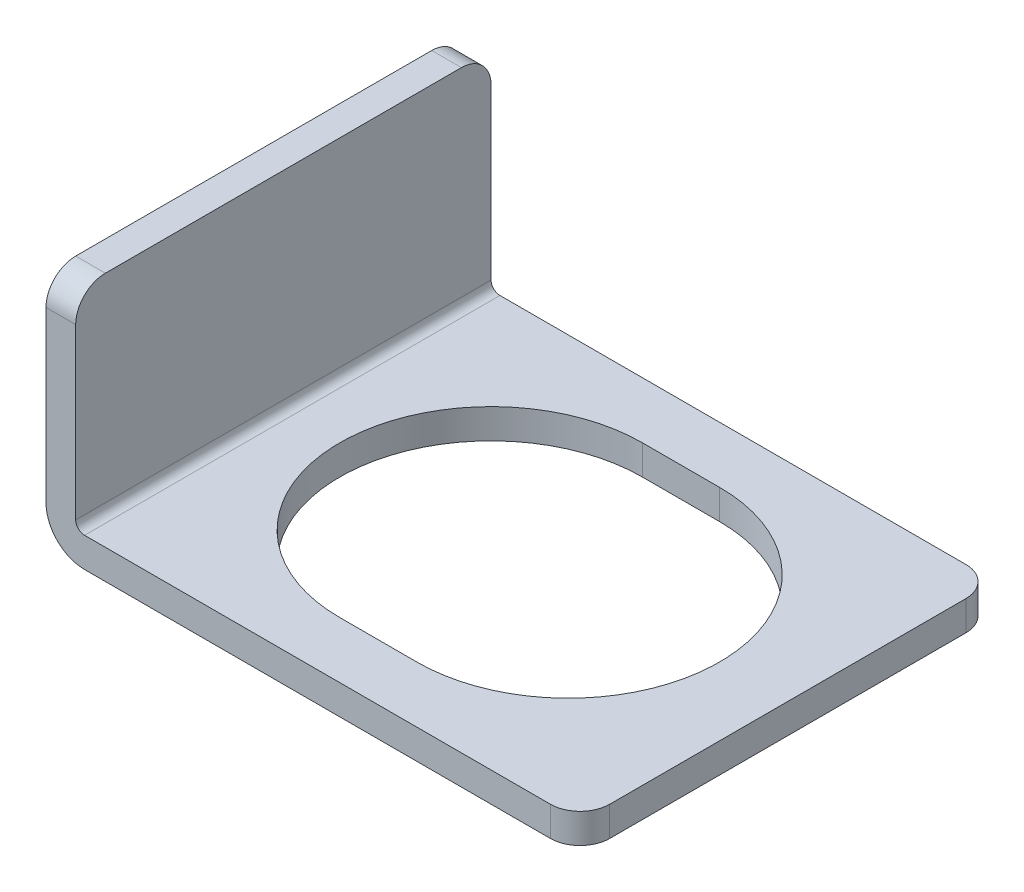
ISO-10303-21;
HEADER;
FILE_DESCRIPTION(('STEP AP214'),'2;1');
FILE_NAME('part.step','',(''),(''),'','','');
FILE_SCHEMA(('AUTOMOTIVE_DESIGN { 1 0 10303 214 1 1 1 1 }'));
ENDSEC;
DATA;
#1=APPLICATION_CONTEXT('core data for automotive mechanical design processes');
#2=APPLICATION_PROTOCOL_DEFINITION('international standard','automotive_design',2000,#1);
#3=PRODUCT_CONTEXT('',#1,'mechanical');
#4=PRODUCT('Part','Part','',(#3));
#5=PRODUCT_RELATED_PRODUCT_CATEGORY('part','',(#4));
#6=PRODUCT_DEFINITION_FORMATION('','',#4);
#7=PRODUCT_DEFINITION_CONTEXT('part definition',#1,'design');
#8=PRODUCT_DEFINITION('design','',#6,#7);
#9=PRODUCT_DEFINITION_SHAPE('','',#8);
#10=(LENGTH_UNIT() NAMED_UNIT(*) SI_UNIT(.MILLI.,.METRE.));
#11=(NAMED_UNIT(*) PLANE_ANGLE_UNIT() SI_UNIT($,.RADIAN.));
#12=(NAMED_UNIT(*) SI_UNIT($,.STERADIAN.) SOLID_ANGLE_UNIT());
#13=UNCERTAINTY_MEASURE_WITH_UNIT(LENGTH_MEASURE(1.E-05),#10,'distance_accuracy_value','');
#14=(GEOMETRIC_REPRESENTATION_CONTEXT(3) GLOBAL_UNCERTAINTY_ASSIGNED_CONTEXT((#13)) GLOBAL_UNIT_ASSIGNED_CONTEXT((#10,
#11,#12)) REPRESENTATION_CONTEXT('',''));
#15=CARTESIAN_POINT('',(0.,0.,0.));
#16=DIRECTION('',(0.,0.,1.));
#17=DIRECTION('',(1.,0.,0.));
#18=AXIS2_PLACEMENT_3D('',#15,#16,#17);
#19=CARTESIAN_POINT('',(-7.,0.3,7.));
#20=DIRECTION('',(-1.,0.,0.));
#21=DIRECTION('',(0.,-1.,0.));
#22=AXIS2_PLACEMENT_3D('',#19,#20,#21);
#23=PLANE('',#22);
#24=DIRECTION('',(0.,1.,0.));
#25=VECTOR('',#24,1.);
#26=CARTESIAN_POINT('',(-7.,0.3,-7.));
#27=LINE('',#26,#25);
#28=CARTESIAN_POINT('',(-7.,0.3,-7.));
#29=VERTEX_POINT('',#28);
#30=CARTESIAN_POINT('',(-7.,6.,-7.));
#31=VERTEX_POINT('',#30);
#32=EDGE_CURVE('E167',#29,#31,#27,.T.);
#33=ORIENTED_EDGE('',*,*,#32,.T.);
#34=CARTESIAN_POINT('',(-7.,6.,-6.));
#35=DIRECTION('',(-1.,0.,0.));
#36=DIRECTION('',(0.,-1.,0.));
#37=AXIS2_PLACEMENT_3D('',#34,#35,#36);
#38=CIRCLE('',#37,1.);
#39=CARTESIAN_POINT('',(-7.,7.,-6.));
#40=VERTEX_POINT('',#39);
#41=EDGE_CURVE('E245',#31,#40,#38,.F.);
#42=ORIENTED_EDGE('',*,*,#41,.T.);
#43=DIRECTION('',(0.,0.,-1.));
#44=VECTOR('',#43,1.);
#45=CARTESIAN_POINT('',(-7.,7.,7.));
#46=LINE('',#45,#44);
#47=CARTESIAN_POINT('',(-7.,7.,6.));
#48=VERTEX_POINT('',#47);
#49=EDGE_CURVE('E218',#48,#40,#46,.T.);
#50=ORIENTED_EDGE('',*,*,#49,.F.);
#51=CARTESIAN_POINT('',(-7.,6.,6.));
#52=DIRECTION('',(-1.,0.,0.));
#53=DIRECTION('',(0.,-1.,0.));
#54=AXIS2_PLACEMENT_3D('',#51,#52,#53);
#55=CIRCLE('',#54,1.);
#56=CARTESIAN_POINT('',(-7.,6.,7.));
#57=VERTEX_POINT('',#56);
#58=EDGE_CURVE('E243',#48,#57,#55,.F.);
#59=ORIENTED_EDGE('',*,*,#58,.T.);
#60=DIRECTION('',(0.,1.,0.));
#61=VECTOR('',#60,1.);
#62=CARTESIAN_POINT('',(-7.,0.3,7.));
#63=LINE('',#62,#61);
#64=CARTESIAN_POINT('',(-7.,0.3,7.));
#65=VERTEX_POINT('',#64);
#66=EDGE_CURVE('E171',#65,#57,#63,.T.);
#67=ORIENTED_EDGE('',*,*,#66,.F.);
#68=DIRECTION('',(0.,0.,-1.));
#69=VECTOR('',#68,1.);
#70=CARTESIAN_POINT('',(-7.,0.3,7.));
#71=LINE('',#70,#69);
#72=EDGE_CURVE('E186',#65,#29,#71,.T.);
#73=ORIENTED_EDGE('',*,*,#72,.T.);
#74=EDGE_LOOP('',(#33,#42,#50,#59,#67,#73));
#75=FACE_BOUND('',#74,.T.);
#76=ADVANCED_FACE('F14',(#75),#23,.F.);
#77=CARTESIAN_POINT('',(-8.,7.,7.));
#78=DIRECTION('',(0.,1.,0.));
#79=DIRECTION('',(0.,0.,1.));
#80=AXIS2_PLACEMENT_3D('',#77,#78,#79);
#81=PLANE('',#80);
#82=ORIENTED_EDGE('',*,*,#49,.T.);
#83=DIRECTION('',(1.,0.,0.));
#84=VECTOR('',#83,1.);
#85=CARTESIAN_POINT('',(-8.,7.,-6.));
#86=LINE('',#85,#84);
#87=CARTESIAN_POINT('',(-8.,7.,-6.));
#88=VERTEX_POINT('',#87);
#89=EDGE_CURVE('E29',#40,#88,#86,.F.);
#90=ORIENTED_EDGE('',*,*,#89,.T.);
#91=DIRECTION('',(0.,0.,-1.));
#92=VECTOR('',#91,1.);
#93=CARTESIAN_POINT('',(-8.,7.,7.));
#94=LINE('',#93,#92);
#95=CARTESIAN_POINT('',(-8.,7.,6.));
#96=VERTEX_POINT('',#95);
#97=EDGE_CURVE('E216',#96,#88,#94,.T.);
#98=ORIENTED_EDGE('',*,*,#97,.F.);
#99=DIRECTION('',(1.,0.,0.));
#100=VECTOR('',#99,1.);
#101=CARTESIAN_POINT('',(-8.,7.,6.));
#102=LINE('',#101,#100);
#103=EDGE_CURVE('E247',#96,#48,#102,.T.);
#104=ORIENTED_EDGE('',*,*,#103,.T.);
#105=EDGE_LOOP('',(#82,#90,#98,#104));
#106=FACE_BOUND('',#105,.T.);
#107=ADVANCED_FACE('F252',(#106),#81,.T.);
#108=CARTESIAN_POINT('',(-8.,0.3,7.));
#109=DIRECTION('',(-1.,0.,0.));
#110=DIRECTION('',(0.,-1.,0.));
#111=AXIS2_PLACEMENT_3D('',#108,#109,#110);
#112=PLANE('',#111);
#113=ORIENTED_EDGE('',*,*,#97,.T.);
#114=CARTESIAN_POINT('',(-8.,6.,-6.));
#115=DIRECTION('',(-1.,0.,0.));
#116=DIRECTION('',(0.,-1.,0.));
#117=AXIS2_PLACEMENT_3D('',#114,#115,#116);
#118=CIRCLE('',#117,1.);
#119=CARTESIAN_POINT('',(-8.,6.,-7.));
#120=VERTEX_POINT('',#119);
#121=EDGE_CURVE('E9',#88,#120,#118,.T.);
#122=ORIENTED_EDGE('',*,*,#121,.T.);
#123=DIRECTION('',(0.,1.,0.));
#124=VECTOR('',#123,1.);
#125=CARTESIAN_POINT('',(-8.,0.3,-7.));
#126=LINE('',#125,#124);
#127=CARTESIAN_POINT('',(-8.,0.3,-7.));
#128=VERTEX_POINT('',#127);
#129=EDGE_CURVE('E189',#128,#120,#126,.T.);
#130=ORIENTED_EDGE('',*,*,#129,.F.);
#131=DIRECTION('',(0.,0.,-1.));
#132=VECTOR('',#131,1.);
#133=CARTESIAN_POINT('',(-8.,0.3,7.));
#134=LINE('',#133,#132);
#135=CARTESIAN_POINT('',(-8.,0.3,7.));
#136=VERTEX_POINT('',#135);
#137=EDGE_CURVE('E214',#136,#128,#134,.T.);
#138=ORIENTED_EDGE('',*,*,#137,.F.);
#139=DIRECTION('',(0.,1.,0.));
#140=VECTOR('',#139,1.);
#141=CARTESIAN_POINT('',(-8.,0.3,7.));
#142=LINE('',#141,#140);
#143=CARTESIAN_POINT('',(-8.,6.,7.));
#144=VERTEX_POINT('',#143);
#145=EDGE_CURVE('E174',#136,#144,#142,.T.);
#146=ORIENTED_EDGE('',*,*,#145,.T.);
#147=CARTESIAN_POINT('',(-8.,6.,6.));
#148=DIRECTION('',(-1.,0.,0.));
#149=DIRECTION('',(0.,-1.,0.));
#150=AXIS2_PLACEMENT_3D('',#147,#148,#149);
#151=CIRCLE('',#150,1.);
#152=EDGE_CURVE('E22',#144,#96,#151,.T.);
#153=ORIENTED_EDGE('',*,*,#152,.T.);
#154=EDGE_LOOP('',(#113,#122,#130,#138,#146,#153));
#155=FACE_BOUND('',#154,.T.);
#156=ADVANCED_FACE('F267',(#155),#112,.T.);
#157=CARTESIAN_POINT('',(-6.7,0.3,7.));
#158=DIRECTION('',(0.,0.,-1.));
#159=DIRECTION('',(-1.,0.,0.));
#160=AXIS2_PLACEMENT_3D('',#157,#158,#159);
#161=CYLINDRICAL_SURFACE('',#160,1.3);
#162=CARTESIAN_POINT('',(-6.7,0.3,-7.));
#163=DIRECTION('',(0.,0.,1.));
#164=DIRECTION('',(1.,0.,0.));
#165=AXIS2_PLACEMENT_3D('',#162,#163,#164);
#166=CIRCLE('',#165,1.3);
#167=CARTESIAN_POINT('',(-6.7,-1.,-7.));
#168=VERTEX_POINT('',#167);
#169=EDGE_CURVE('E192',#168,#128,#166,.F.);
#170=ORIENTED_EDGE('',*,*,#169,.F.);
#171=DIRECTION('',(0.,0.,-1.));
#172=VECTOR('',#171,1.);
#173=CARTESIAN_POINT('',(-6.7,-1.,7.));
#174=LINE('',#173,#172);
#175=CARTESIAN_POINT('',(-6.7,-1.,7.));
#176=VERTEX_POINT('',#175);
#177=EDGE_CURVE('E211',#176,#168,#174,.T.);
#178=ORIENTED_EDGE('',*,*,#177,.F.);
#179=CARTESIAN_POINT('',(-6.7,0.3,7.));
#180=DIRECTION('',(0.,0.,1.));
#181=DIRECTION('',(1.,0.,0.));
#182=AXIS2_PLACEMENT_3D('',#179,#180,#181);
#183=CIRCLE('',#182,1.3);
#184=EDGE_CURVE('E177',#176,#136,#183,.F.);
#185=ORIENTED_EDGE('',*,*,#184,.T.);
#186=ORIENTED_EDGE('',*,*,#137,.T.);
#187=EDGE_LOOP('',(#170,#178,#185,#186));
#188=FACE_BOUND('',#187,.T.);
#189=ADVANCED_FACE('F276',(#188),#161,.T.);
#190=CARTESIAN_POINT('',(0.,-1.,7.));
#191=DIRECTION('',(0.,-1.,0.));
#192=DIRECTION('',(0.,0.,-1.));
#193=AXIS2_PLACEMENT_3D('',#190,#191,#192);
#194=PLANE('',#193);
#195=CARTESIAN_POINT('',(0.,-1.,0.));
#196=DIRECTION('',(0.,1.,0.));
#197=DIRECTION('',(-1.,0.,0.));
#198=AXIS2_PLACEMENT_3D('',#195,#196,#197);
#199=CIRCLE('',#198,5.1);
#200=CARTESIAN_POINT('',(0.,-1.,-5.1));
#201=VERTEX_POINT('',#200);
#202=CARTESIAN_POINT('',(0.,-1.,5.1));
#203=VERTEX_POINT('',#202);
#204=EDGE_CURVE('E131',#201,#203,#199,.T.);
#205=ORIENTED_EDGE('',*,*,#204,.T.);
#206=DIRECTION('',(1.,0.,0.));
#207=VECTOR('',#206,1.);
#208=CARTESIAN_POINT('',(0.,-1.,5.1));
#209=LINE('',#208,#207);
#210=CARTESIAN_POINT('',(2.6,-1.,5.1));
#211=VERTEX_POINT('',#210);
#212=EDGE_CURVE('E143',#203,#211,#209,.T.);
#213=ORIENTED_EDGE('',*,*,#212,.T.);
#214=CARTESIAN_POINT('',(2.6,-1.,0.));
#215=DIRECTION('',(0.,1.,0.));
#216=DIRECTION('',(1.,0.,0.));
#217=AXIS2_PLACEMENT_3D('',#214,#215,#216);
#218=CIRCLE('',#217,5.1);
#219=CARTESIAN_POINT('',(2.6,-1.,-5.1));
#220=VERTEX_POINT('',#219);
#221=EDGE_CURVE('E147',#211,#220,#218,.T.);
#222=ORIENTED_EDGE('',*,*,#221,.T.);
#223=DIRECTION('',(-1.,0.,0.));
#224=VECTOR('',#223,1.);
#225=CARTESIAN_POINT('',(0.,-1.,-5.1));
#226=LINE('',#225,#224);
#227=EDGE_CURVE('E139',#220,#201,#226,.T.);
#228=ORIENTED_EDGE('',*,*,#227,.T.);
#229=EDGE_LOOP('',(#205,#213,#222,#228));
#230=FACE_BOUND('',#229,.T.);
#231=DIRECTION('',(1.,0.,0.));
#232=VECTOR('',#231,1.);
#233=CARTESIAN_POINT('',(0.,-1.,-7.));
#234=LINE('',#233,#232);
#235=CARTESIAN_POINT('',(9.,-1.,-7.));
#236=VERTEX_POINT('',#235);
#237=EDGE_CURVE('E195',#236,#168,#234,.F.);
#238=ORIENTED_EDGE('',*,*,#237,.F.);
#239=CARTESIAN_POINT('',(9.,-1.,-6.));
#240=DIRECTION('',(0.,-1.,0.));
#241=DIRECTION('',(0.,0.,-1.));
#242=AXIS2_PLACEMENT_3D('',#239,#240,#241);
#243=CIRCLE('',#242,1.);
#244=CARTESIAN_POINT('',(10.,-1.,-6.));
#245=VERTEX_POINT('',#244);
#246=EDGE_CURVE('E228',#236,#245,#243,.T.);
#247=ORIENTED_EDGE('',*,*,#246,.T.);
#248=DIRECTION('',(0.,0.,-1.));
#249=VECTOR('',#248,1.);
#250=CARTESIAN_POINT('',(10.,-1.,7.));
#251=LINE('',#250,#249);
#252=CARTESIAN_POINT('',(10.,-1.,6.));
#253=VERTEX_POINT('',#252);
#254=EDGE_CURVE('E208',#253,#245,#251,.T.);
#255=ORIENTED_EDGE('',*,*,#254,.F.);
#256=CARTESIAN_POINT('',(9.,-1.,6.));
#257=DIRECTION('',(0.,-1.,0.));
#258=DIRECTION('',(0.,0.,-1.));
#259=AXIS2_PLACEMENT_3D('',#256,#257,#258);
#260=CIRCLE('',#259,1.);
#261=CARTESIAN_POINT('',(9.,-1.,7.));
#262=VERTEX_POINT('',#261);
#263=EDGE_CURVE('E226',#253,#262,#260,.T.);
#264=ORIENTED_EDGE('',*,*,#263,.T.);
#265=DIRECTION('',(-1.,0.,0.));
#266=VECTOR('',#265,1.);
#267=CARTESIAN_POINT('',(0.,-1.,7.));
#268=LINE('',#267,#266);
#269=EDGE_CURVE('E180',#262,#176,#268,.T.);
#270=ORIENTED_EDGE('',*,*,#269,.T.);
#271=ORIENTED_EDGE('',*,*,#177,.T.);
#272=EDGE_LOOP('',(#238,#247,#255,#264,#270,#271));
#273=FACE_BOUND('',#272,.T.);
#274=ADVANCED_FACE('F149',(#230,#273),#194,.T.);
#275=CARTESIAN_POINT('',(10.,0.,7.));
#276=DIRECTION('',(1.,0.,0.));
#277=DIRECTION('',(0.,0.,-1.));
#278=AXIS2_PLACEMENT_3D('',#275,#276,#277);
#279=PLANE('',#278);
#280=ORIENTED_EDGE('',*,*,#254,.T.);
#281=DIRECTION('',(0.,-1.,0.));
#282=VECTOR('',#281,1.);
#283=CARTESIAN_POINT('',(10.,0.,-6.));
#284=LINE('',#283,#282);
#285=CARTESIAN_POINT('',(10.,0.,-6.));
#286=VERTEX_POINT('',#285);
#287=EDGE_CURVE('E233',#245,#286,#284,.F.);
#288=ORIENTED_EDGE('',*,*,#287,.T.);
#289=DIRECTION('',(0.,0.,-1.));
#290=VECTOR('',#289,1.);
#291=CARTESIAN_POINT('',(10.,0.,7.));
#292=LINE('',#291,#290);
#293=CARTESIAN_POINT('',(10.,0.,6.));
#294=VERTEX_POINT('',#293);
#295=EDGE_CURVE('E205',#294,#286,#292,.T.);
#296=ORIENTED_EDGE('',*,*,#295,.F.);
#297=DIRECTION('',(0.,-1.,0.));
#298=VECTOR('',#297,1.);
#299=CARTESIAN_POINT('',(10.,0.,6.));
#300=LINE('',#299,#298);
#301=EDGE_CURVE('E230',#294,#253,#300,.T.);
#302=ORIENTED_EDGE('',*,*,#301,.T.);
#303=EDGE_LOOP('',(#280,#288,#296,#302));
#304=FACE_BOUND('',#303,.T.);
#305=ADVANCED_FACE('F291',(#304),#279,.T.);
#306=CARTESIAN_POINT('',(0.,0.,7.));
#307=DIRECTION('',(0.,-1.,0.));
#308=DIRECTION('',(1.,0.,0.));
#309=AXIS2_PLACEMENT_3D('',#306,#307,#308);
#310=PLANE('',#309);
#311=DIRECTION('',(1.,0.,0.));
#312=VECTOR('',#311,1.);
#313=CARTESIAN_POINT('',(0.,0.,5.1));
#314=LINE('',#313,#312);
#315=CARTESIAN_POINT('',(0.,0.,5.1));
#316=VERTEX_POINT('',#315);
#317=CARTESIAN_POINT('',(2.6,0.,5.1));
#318=VERTEX_POINT('',#317);
#319=EDGE_CURVE('E161',#316,#318,#314,.T.);
#320=ORIENTED_EDGE('',*,*,#319,.F.);
#321=CARTESIAN_POINT('',(0.,0.,0.));
#322=DIRECTION('',(0.,1.,0.));
#323=DIRECTION('',(-1.,0.,0.));
#324=AXIS2_PLACEMENT_3D('',#321,#322,#323);
#325=CIRCLE('',#324,5.1);
#326=CARTESIAN_POINT('',(0.,0.,-5.1));
#327=VERTEX_POINT('',#326);
#328=EDGE_CURVE('E134',#327,#316,#325,.T.);
#329=ORIENTED_EDGE('',*,*,#328,.F.);
#330=DIRECTION('',(-1.,0.,0.));
#331=VECTOR('',#330,1.);
#332=CARTESIAN_POINT('',(0.,0.,-5.1));
#333=LINE('',#332,#331);
#334=CARTESIAN_POINT('',(2.6,0.,-5.1));
#335=VERTEX_POINT('',#334);
#336=EDGE_CURVE('E152',#335,#327,#333,.T.);
#337=ORIENTED_EDGE('',*,*,#336,.F.);
#338=CARTESIAN_POINT('',(2.6,0.,0.));
#339=DIRECTION('',(0.,1.,0.));
#340=DIRECTION('',(1.,0.,0.));
#341=AXIS2_PLACEMENT_3D('',#338,#339,#340);
#342=CIRCLE('',#341,5.1);
#343=EDGE_CURVE('E155',#318,#335,#342,.T.);
#344=ORIENTED_EDGE('',*,*,#343,.F.);
#345=EDGE_LOOP('',(#320,#329,#337,#344));
#346=FACE_BOUND('',#345,.T.);
#347=ORIENTED_EDGE('',*,*,#295,.T.);
#348=CARTESIAN_POINT('',(9.,0.,-6.));
#349=DIRECTION('',(0.,-1.,0.));
#350=DIRECTION('',(1.,0.,0.));
#351=AXIS2_PLACEMENT_3D('',#348,#349,#350);
#352=CIRCLE('',#351,1.);
#353=CARTESIAN_POINT('',(9.,0.,-7.));
#354=VERTEX_POINT('',#353);
#355=EDGE_CURVE('E237',#286,#354,#352,.F.);
#356=ORIENTED_EDGE('',*,*,#355,.T.);
#357=DIRECTION('',(-1.,0.,0.));
#358=VECTOR('',#357,1.);
#359=CARTESIAN_POINT('',(0.,0.,-7.));
#360=LINE('',#359,#358);
#361=CARTESIAN_POINT('',(-6.7,0.,-7.));
#362=VERTEX_POINT('',#361);
#363=EDGE_CURVE('E197',#354,#362,#360,.T.);
#364=ORIENTED_EDGE('',*,*,#363,.T.);
#365=DIRECTION('',(0.,0.,-1.));
#366=VECTOR('',#365,1.);
#367=CARTESIAN_POINT('',(-6.7,0.,7.));
#368=LINE('',#367,#366);
#369=CARTESIAN_POINT('',(-6.7,0.,7.));
#370=VERTEX_POINT('',#369);
#371=EDGE_CURVE('E202',#370,#362,#368,.T.);
#372=ORIENTED_EDGE('',*,*,#371,.F.);
#373=DIRECTION('',(-1.,0.,0.));
#374=VECTOR('',#373,1.);
#375=CARTESIAN_POINT('',(0.,0.,7.));
#376=LINE('',#375,#374);
#377=CARTESIAN_POINT('',(9.,0.,7.));
#378=VERTEX_POINT('',#377);
#379=EDGE_CURVE('E182',#378,#370,#376,.T.);
#380=ORIENTED_EDGE('',*,*,#379,.F.);
#381=CARTESIAN_POINT('',(9.,0.,6.));
#382=DIRECTION('',(0.,-1.,0.));
#383=DIRECTION('',(1.,0.,0.));
#384=AXIS2_PLACEMENT_3D('',#381,#382,#383);
#385=CIRCLE('',#384,1.);
#386=EDGE_CURVE('E235',#378,#294,#385,.F.);
#387=ORIENTED_EDGE('',*,*,#386,.T.);
#388=EDGE_LOOP('',(#347,#356,#364,#372,#380,#387));
#389=FACE_BOUND('',#388,.T.);
#390=ADVANCED_FACE('F287',(#346,#389),#310,.F.);
#391=CARTESIAN_POINT('',(-6.7,0.3,7.));
#392=DIRECTION('',(0.,0.,-1.));
#393=DIRECTION('',(-1.,0.,0.));
#394=AXIS2_PLACEMENT_3D('',#391,#392,#393);
#395=CYLINDRICAL_SURFACE('',#394,0.3);
#396=CARTESIAN_POINT('',(-6.7,0.3,-7.));
#397=DIRECTION('',(0.,0.,-1.));
#398=DIRECTION('',(-1.,0.,0.));
#399=AXIS2_PLACEMENT_3D('',#396,#397,#398);
#400=CIRCLE('',#399,0.3);
#401=EDGE_CURVE('E175',#362,#29,#400,.T.);
#402=ORIENTED_EDGE('',*,*,#401,.T.);
#403=ORIENTED_EDGE('',*,*,#72,.F.);
#404=CARTESIAN_POINT('',(-6.7,0.3,7.));
#405=DIRECTION('',(0.,0.,-1.));
#406=DIRECTION('',(-1.,0.,0.));
#407=AXIS2_PLACEMENT_3D('',#404,#405,#406);
#408=CIRCLE('',#407,0.3);
#409=EDGE_CURVE('E184',#370,#65,#408,.T.);
#410=ORIENTED_EDGE('',*,*,#409,.F.);
#411=ORIENTED_EDGE('',*,*,#371,.T.);
#412=EDGE_LOOP('',(#402,#403,#410,#411));
#413=FACE_BOUND('',#412,.T.);
#414=ADVANCED_FACE('F298',(#413),#395,.F.);
#415=CARTESIAN_POINT('',(-6.7,0.3,7.));
#416=DIRECTION('',(0.,0.,1.));
#417=DIRECTION('',(1.,0.,0.));
#418=AXIS2_PLACEMENT_3D('',#415,#416,#417);
#419=PLANE('',#418);
#420=ORIENTED_EDGE('',*,*,#269,.F.);
#421=DIRECTION('',(0.,-1.,0.));
#422=VECTOR('',#421,1.);
#423=CARTESIAN_POINT('',(9.,0.3,7.));
#424=LINE('',#423,#422);
#425=EDGE_CURVE('E241',#262,#378,#424,.F.);
#426=ORIENTED_EDGE('',*,*,#425,.T.);
#427=ORIENTED_EDGE('',*,*,#379,.T.);
#428=ORIENTED_EDGE('',*,*,#409,.T.);
#429=ORIENTED_EDGE('',*,*,#66,.T.);
#430=DIRECTION('',(1.,0.,0.));
#431=VECTOR('',#430,1.);
#432=CARTESIAN_POINT('',(-6.7,6.,7.));
#433=LINE('',#432,#431);
#434=EDGE_CURVE('E239',#57,#144,#433,.F.);
#435=ORIENTED_EDGE('',*,*,#434,.T.);
#436=ORIENTED_EDGE('',*,*,#145,.F.);
#437=ORIENTED_EDGE('',*,*,#184,.F.);
#438=EDGE_LOOP('',(#420,#426,#427,#428,#429,#435,#436,#437));
#439=FACE_BOUND('',#438,.T.);
#440=ADVANCED_FACE('F273',(#439),#419,.T.);
#441=CARTESIAN_POINT('',(-6.7,0.3,-7.));
#442=DIRECTION('',(0.,0.,1.));
#443=DIRECTION('',(1.,0.,0.));
#444=AXIS2_PLACEMENT_3D('',#441,#442,#443);
#445=PLANE('',#444);
#446=ORIENTED_EDGE('',*,*,#363,.F.);
#447=DIRECTION('',(0.,-1.,0.));
#448=VECTOR('',#447,1.);
#449=CARTESIAN_POINT('',(9.,-1.,-7.));
#450=LINE('',#449,#448);
#451=EDGE_CURVE('E223',#354,#236,#450,.T.);
#452=ORIENTED_EDGE('',*,*,#451,.T.);
#453=ORIENTED_EDGE('',*,*,#237,.T.);
#454=ORIENTED_EDGE('',*,*,#169,.T.);
#455=ORIENTED_EDGE('',*,*,#129,.T.);
#456=DIRECTION('',(1.,0.,0.));
#457=VECTOR('',#456,1.);
#458=CARTESIAN_POINT('',(-7.,6.,-7.));
#459=LINE('',#458,#457);
#460=EDGE_CURVE('E220',#120,#31,#459,.T.);
#461=ORIENTED_EDGE('',*,*,#460,.T.);
#462=ORIENTED_EDGE('',*,*,#32,.F.);
#463=ORIENTED_EDGE('',*,*,#401,.F.);
#464=EDGE_LOOP('',(#446,#452,#453,#454,#455,#461,#462,#463));
#465=FACE_BOUND('',#464,.T.);
#466=ADVANCED_FACE('F263',(#465),#445,.F.);
#467=CARTESIAN_POINT('',(0.,-1.,0.));
#468=DIRECTION('',(0.,1.,0.));
#469=DIRECTION('',(-1.,0.,0.));
#470=AXIS2_PLACEMENT_3D('',#467,#468,#469);
#471=CYLINDRICAL_SURFACE('',#470,5.1);
#472=ORIENTED_EDGE('',*,*,#328,.T.);
#473=DIRECTION('',(0.,1.,0.));
#474=VECTOR('',#473,1.);
#475=CARTESIAN_POINT('',(0.,-1.,5.1));
#476=LINE('',#475,#474);
#477=EDGE_CURVE('E127',#203,#316,#476,.T.);
#478=ORIENTED_EDGE('',*,*,#477,.F.);
#479=ORIENTED_EDGE('',*,*,#204,.F.);
#480=DIRECTION('',(0.,1.,0.));
#481=VECTOR('',#480,1.);
#482=CARTESIAN_POINT('',(0.,-1.,-5.1));
#483=LINE('',#482,#481);
#484=EDGE_CURVE('E165',#201,#327,#483,.T.);
#485=ORIENTED_EDGE('',*,*,#484,.T.);
#486=EDGE_LOOP('',(#472,#478,#479,#485));
#487=FACE_BOUND('',#486,.T.);
#488=ADVANCED_FACE('F129',(#487),#471,.F.);
#489=CARTESIAN_POINT('',(0.,-1.,-5.1));
#490=DIRECTION('',(0.,0.,-1.));
#491=DIRECTION('',(-1.,0.,0.));
#492=AXIS2_PLACEMENT_3D('',#489,#490,#491);
#493=PLANE('',#492);
#494=ORIENTED_EDGE('',*,*,#336,.T.);
#495=ORIENTED_EDGE('',*,*,#484,.F.);
#496=ORIENTED_EDGE('',*,*,#227,.F.);
#497=DIRECTION('',(0.,1.,0.));
#498=VECTOR('',#497,1.);
#499=CARTESIAN_POINT('',(2.6,-1.,-5.1));
#500=LINE('',#499,#498);
#501=EDGE_CURVE('E168',#220,#335,#500,.T.);
#502=ORIENTED_EDGE('',*,*,#501,.T.);
#503=EDGE_LOOP('',(#494,#495,#496,#502));
#504=FACE_BOUND('',#503,.T.);
#505=ADVANCED_FACE('F369',(#504),#493,.F.);
#506=CARTESIAN_POINT('',(2.6,-1.,0.));
#507=DIRECTION('',(0.,1.,0.));
#508=DIRECTION('',(-1.,0.,0.));
#509=AXIS2_PLACEMENT_3D('',#506,#507,#508);
#510=CYLINDRICAL_SURFACE('',#509,5.1);
#511=ORIENTED_EDGE('',*,*,#343,.T.);
#512=ORIENTED_EDGE('',*,*,#501,.F.);
#513=ORIENTED_EDGE('',*,*,#221,.F.);
#514=DIRECTION('',(0.,1.,0.));
#515=VECTOR('',#514,1.);
#516=CARTESIAN_POINT('',(2.6,-1.,5.1));
#517=LINE('',#516,#515);
#518=EDGE_CURVE('E138',#211,#318,#517,.T.);
#519=ORIENTED_EDGE('',*,*,#518,.T.);
#520=EDGE_LOOP('',(#511,#512,#513,#519));
#521=FACE_BOUND('',#520,.T.);
#522=ADVANCED_FACE('F362',(#521),#510,.F.);
#523=CARTESIAN_POINT('',(0.,-1.,5.1));
#524=DIRECTION('',(0.,0.,1.));
#525=DIRECTION('',(1.,0.,0.));
#526=AXIS2_PLACEMENT_3D('',#523,#524,#525);
#527=PLANE('',#526);
#528=ORIENTED_EDGE('',*,*,#319,.T.);
#529=ORIENTED_EDGE('',*,*,#518,.F.);
#530=ORIENTED_EDGE('',*,*,#212,.F.);
#531=ORIENTED_EDGE('',*,*,#477,.T.);
#532=EDGE_LOOP('',(#528,#529,#530,#531));
#533=FACE_BOUND('',#532,.T.);
#534=ADVANCED_FACE('F144',(#533),#527,.F.);
#535=CARTESIAN_POINT('',(9.,0.3,-6.));
#536=DIRECTION('',(0.,1.,0.));
#537=DIRECTION('',(0.,0.,1.));
#538=AXIS2_PLACEMENT_3D('',#535,#536,#537);
#539=CYLINDRICAL_SURFACE('',#538,1.);
#540=ORIENTED_EDGE('',*,*,#355,.F.);
#541=ORIENTED_EDGE('',*,*,#287,.F.);
#542=ORIENTED_EDGE('',*,*,#246,.F.);
#543=ORIENTED_EDGE('',*,*,#451,.F.);
#544=EDGE_LOOP('',(#540,#541,#542,#543));
#545=FACE_BOUND('',#544,.T.);
#546=ADVANCED_FACE('F294',(#545),#539,.T.);
#547=CARTESIAN_POINT('',(9.,0.,6.));
#548=DIRECTION('',(0.,-1.,0.));
#549=DIRECTION('',(0.,0.,-1.));
#550=AXIS2_PLACEMENT_3D('',#547,#548,#549);
#551=CYLINDRICAL_SURFACE('',#550,1.);
#552=ORIENTED_EDGE('',*,*,#386,.F.);
#553=ORIENTED_EDGE('',*,*,#425,.F.);
#554=ORIENTED_EDGE('',*,*,#263,.F.);
#555=ORIENTED_EDGE('',*,*,#301,.F.);
#556=EDGE_LOOP('',(#552,#553,#554,#555));
#557=FACE_BOUND('',#556,.T.);
#558=ADVANCED_FACE('F283',(#557),#551,.T.);
#559=CARTESIAN_POINT('',(-6.7,6.,-6.));
#560=DIRECTION('',(-1.,0.,0.));
#561=DIRECTION('',(0.,0.,1.));
#562=AXIS2_PLACEMENT_3D('',#559,#560,#561);
#563=CYLINDRICAL_SURFACE('',#562,1.);
#564=ORIENTED_EDGE('',*,*,#121,.F.);
#565=ORIENTED_EDGE('',*,*,#89,.F.);
#566=ORIENTED_EDGE('',*,*,#41,.F.);
#567=ORIENTED_EDGE('',*,*,#460,.F.);
#568=EDGE_LOOP('',(#564,#565,#566,#567));
#569=FACE_BOUND('',#568,.T.);
#570=ADVANCED_FACE('F260',(#569),#563,.T.);
#571=CARTESIAN_POINT('',(-8.,6.,6.));
#572=DIRECTION('',(1.,0.,0.));
#573=DIRECTION('',(0.,0.,-1.));
#574=AXIS2_PLACEMENT_3D('',#571,#572,#573);
#575=CYLINDRICAL_SURFACE('',#574,1.);
#576=ORIENTED_EDGE('',*,*,#152,.F.);
#577=ORIENTED_EDGE('',*,*,#434,.F.);
#578=ORIENTED_EDGE('',*,*,#58,.F.);
#579=ORIENTED_EDGE('',*,*,#103,.F.);
#580=EDGE_LOOP('',(#576,#577,#578,#579));
#581=FACE_BOUND('',#580,.T.);
#582=ADVANCED_FACE('F16',(#581),#575,.T.);
#583=CLOSED_SHELL('',(#76,#107,#156,#189,#274,#305,#390,#414,#440,#466,#488,#505,#522,#534,#546,
#558,#570,#582));
#584=MANIFOLD_SOLID_BREP('B1',#583);
#585=ADVANCED_BREP_SHAPE_REPRESENTATION('',(#18,#584),#14);
#586=SHAPE_DEFINITION_REPRESENTATION(#9,#585);
ENDSEC;
END-ISO-10303-21;
